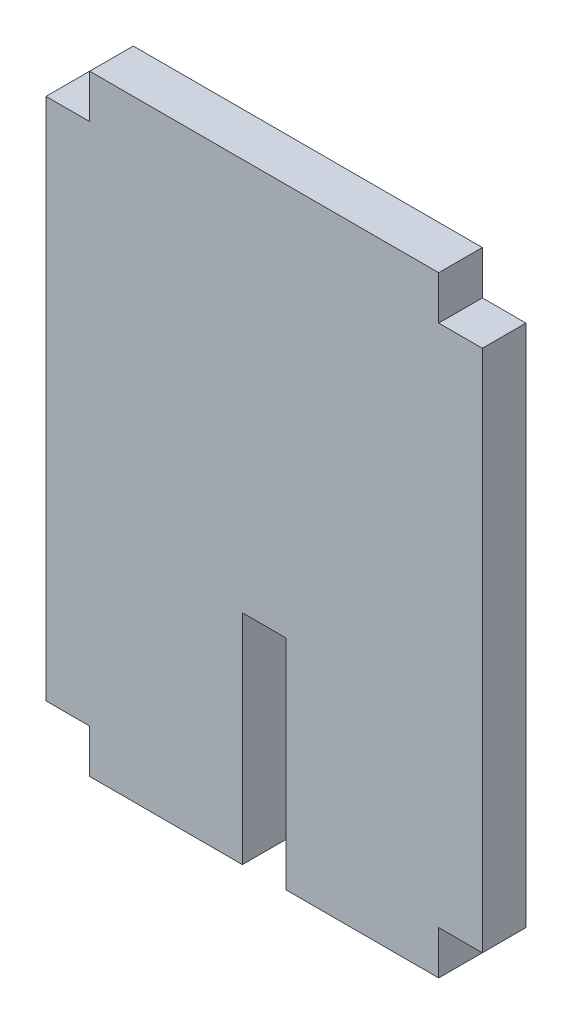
from build123d import *

# Parameters (mm, degrees)
SKETCH1_W           = 31.75
SKETCH1_H           = 44.45
BOSS_EXTRUDE1_DEPTH = 3.175
SKETCH2_W           = 3.175
SKETCH2_H           = 3.175
CUT_EXTRUDE1_DEPTH  = 28.49630657
SKETCH3_W           = 3.175
SKETCH3_H           = 15.875
CUT_EXTRUDE2_DEPTH  = 28.49630657


with BuildPart() as part:
    # Sketch1 → Boss-Extrude1 (new body)
    with BuildSketch(Plane.XY):
        Rectangle(SKETCH1_W, SKETCH1_H)
    extrude(amount=BOSS_EXTRUDE1_DEPTH)

    # Sketch2 → Cut-Extrude1 (cut, through all)
    with BuildSketch(Plane.XY.offset(3.175)):
        with Locations((-14.2875, 20.6375)):
            Rectangle(SKETCH2_W, SKETCH2_H)
        with Locations((14.2875, 20.6375)):
            Rectangle(SKETCH2_W, SKETCH2_H)
        with Locations((14.2875, -20.6375)):
            Rectangle(SKETCH2_W, SKETCH2_H)
        with Locations((-14.2875, -20.6375)):
            Rectangle(SKETCH2_W, SKETCH2_H)
    extrude(amount=-CUT_EXTRUDE1_DEPTH, mode=Mode.SUBTRACT)

    # Sketch3 → Cut-Extrude2 (cut, through all)
    with BuildSketch(Plane.XY.offset(3.175)):
        with Locations((0, -14.2875)):
            Rectangle(SKETCH3_W, SKETCH3_H)
    extrude(amount=-CUT_EXTRUDE2_DEPTH, mode=Mode.SUBTRACT)


solid = part.part
